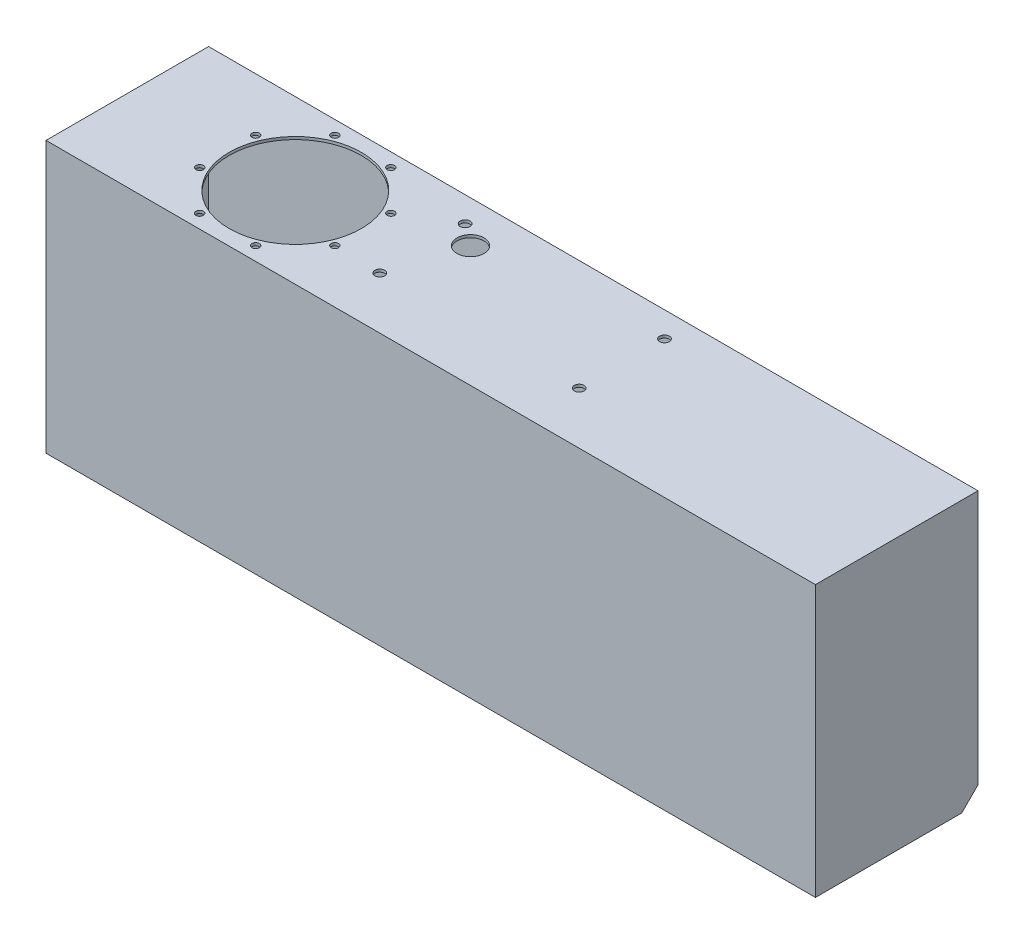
ISO-10303-21;
HEADER;
FILE_DESCRIPTION(('STEP AP214'),'2;1');
FILE_NAME('part.step','',(''),(''),'','','');
FILE_SCHEMA(('AUTOMOTIVE_DESIGN { 1 0 10303 214 1 1 1 1 }'));
ENDSEC;
DATA;
#1=APPLICATION_CONTEXT('core data for automotive mechanical design processes');
#2=APPLICATION_PROTOCOL_DEFINITION('international standard','automotive_design',2000,#1);
#3=PRODUCT_CONTEXT('',#1,'mechanical');
#4=PRODUCT('Part','Part','',(#3));
#5=PRODUCT_RELATED_PRODUCT_CATEGORY('part','',(#4));
#6=PRODUCT_DEFINITION_FORMATION('','',#4);
#7=PRODUCT_DEFINITION_CONTEXT('part definition',#1,'design');
#8=PRODUCT_DEFINITION('design','',#6,#7);
#9=PRODUCT_DEFINITION_SHAPE('','',#8);
#10=(LENGTH_UNIT() NAMED_UNIT(*) SI_UNIT(.MILLI.,.METRE.));
#11=(NAMED_UNIT(*) PLANE_ANGLE_UNIT() SI_UNIT($,.RADIAN.));
#12=(NAMED_UNIT(*) SI_UNIT($,.STERADIAN.) SOLID_ANGLE_UNIT());
#13=UNCERTAINTY_MEASURE_WITH_UNIT(LENGTH_MEASURE(1.E-05),#10,'distance_accuracy_value','');
#14=(GEOMETRIC_REPRESENTATION_CONTEXT(3) GLOBAL_UNCERTAINTY_ASSIGNED_CONTEXT((#13)) GLOBAL_UNIT_ASSIGNED_CONTEXT((#10,
#11,#12)) REPRESENTATION_CONTEXT('',''));
#15=CARTESIAN_POINT('',(0.,0.,0.));
#16=DIRECTION('',(0.,0.,1.));
#17=DIRECTION('',(1.,0.,0.));
#18=AXIS2_PLACEMENT_3D('',#15,#16,#17);
#19=CARTESIAN_POINT('',(0.,17.5000000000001,2.5));
#20=DIRECTION('',(0.,-0.707106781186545,-0.70710678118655));
#21=DIRECTION('',(0.,0.70710678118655,-0.707106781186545));
#22=AXIS2_PLACEMENT_3D('',#19,#20,#21);
#23=PLANE('',#22);
#24=CARTESIAN_POINT('',(255.,-1.90192378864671,21.9019237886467));
#25=DIRECTION('',(0.,-0.707106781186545,-0.70710678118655));
#26=DIRECTION('',(0.,-0.70710678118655,0.707106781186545));
#27=AXIS2_PLACEMENT_3D('',#24,#25,#26);
#28=ELLIPSE('',#27,12.9409522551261,12.5);
#29=CARTESIAN_POINT('',(265.95865642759,2.5,17.5));
#30=VERTEX_POINT('',#29);
#31=CARTESIAN_POINT('',(244.04134357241,2.5,17.5));
#32=VERTEX_POINT('',#31);
#33=EDGE_CURVE('E47',#30,#32,#28,.F.);
#34=ORIENTED_EDGE('',*,*,#33,.F.);
#35=DIRECTION('',(-1.,0.,0.));
#36=VECTOR('',#35,1.);
#37=CARTESIAN_POINT('',(2.5,2.5,17.5));
#38=LINE('',#37,#36);
#39=CARTESIAN_POINT('',(707.5,2.5,17.5));
#40=VERTEX_POINT('',#39);
#41=EDGE_CURVE('E144',#40,#30,#38,.T.);
#42=ORIENTED_EDGE('',*,*,#41,.F.);
#43=DIRECTION('',(0.,-0.70710678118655,0.707106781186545));
#44=VECTOR('',#43,1.);
#45=CARTESIAN_POINT('',(707.5,-62.5,82.4999999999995));
#46=LINE('',#45,#44);
#47=CARTESIAN_POINT('',(707.5,17.5000000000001,2.5));
#48=VERTEX_POINT('',#47);
#49=EDGE_CURVE('E235',#48,#40,#46,.T.);
#50=ORIENTED_EDGE('',*,*,#49,.F.);
#51=DIRECTION('',(1.,0.,0.));
#52=VECTOR('',#51,1.);
#53=CARTESIAN_POINT('',(0.,17.5000000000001,2.5));
#54=LINE('',#53,#52);
#55=CARTESIAN_POINT('',(2.5,17.5000000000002,2.49999999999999));
#56=VERTEX_POINT('',#55);
#57=EDGE_CURVE('E232',#56,#48,#54,.T.);
#58=ORIENTED_EDGE('',*,*,#57,.F.);
#59=DIRECTION('',(0.,0.70710678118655,-0.707106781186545));
#60=VECTOR('',#59,1.);
#61=CARTESIAN_POINT('',(2.5,60.0000000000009,-40.0000000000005));
#62=LINE('',#61,#60);
#63=CARTESIAN_POINT('',(2.5,2.49999999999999,17.5000000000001));
#64=VERTEX_POINT('',#63);
#65=EDGE_CURVE('E142',#64,#56,#62,.T.);
#66=ORIENTED_EDGE('',*,*,#65,.F.);
#67=CARTESIAN_POINT('',(66.5358983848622,2.5,17.5));
#68=VERTEX_POINT('',#67);
#69=EDGE_CURVE('E164',#68,#64,#38,.T.);
#70=ORIENTED_EDGE('',*,*,#69,.F.);
#71=CARTESIAN_POINT('',(70.,-3.00000000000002,23.));
#72=DIRECTION('',(0.,-0.707106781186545,-0.70710678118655));
#73=DIRECTION('',(0.,-0.70710678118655,0.707106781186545));
#74=AXIS2_PLACEMENT_3D('',#71,#72,#73);
#75=ELLIPSE('',#74,9.19238815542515,6.5);
#76=CARTESIAN_POINT('',(73.4641016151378,2.5,17.5));
#77=VERTEX_POINT('',#76);
#78=EDGE_CURVE('E157',#68,#77,#75,.T.);
#79=ORIENTED_EDGE('',*,*,#78,.T.);
#80=EDGE_CURVE('E162',#32,#77,#38,.T.);
#81=ORIENTED_EDGE('',*,*,#80,.F.);
#82=EDGE_LOOP('',(#34,#42,#50,#58,#66,#70,#79,#81));
#83=FACE_BOUND('',#82,.T.);
#84=ADVANCED_FACE('F33',(#83),#23,.F.);
#85=CARTESIAN_POINT('',(2.5,2.5,147.5));
#86=DIRECTION('',(0.,1.,0.));
#87=DIRECTION('',(0.,0.,1.));
#88=AXIS2_PLACEMENT_3D('',#85,#86,#87);
#89=PLANE('',#88);
#90=ORIENTED_EDGE('',*,*,#41,.T.);
#91=CARTESIAN_POINT('',(255.,2.5,24.443375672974));
#92=DIRECTION('',(0.,1.,0.));
#93=DIRECTION('',(0.,0.,-1.));
#94=AXIS2_PLACEMENT_3D('',#91,#92,#93);
#95=ELLIPSE('',#94,14.4337567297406,12.5);
#96=EDGE_CURVE('E135',#30,#32,#95,.F.);
#97=ORIENTED_EDGE('',*,*,#96,.T.);
#98=ORIENTED_EDGE('',*,*,#80,.T.);
#99=CARTESIAN_POINT('',(70.,2.5,23.));
#100=DIRECTION('',(0.,1.,0.));
#101=DIRECTION('',(0.,0.,1.));
#102=AXIS2_PLACEMENT_3D('',#99,#100,#101);
#103=CIRCLE('',#102,6.5);
#104=EDGE_CURVE('E41',#68,#77,#103,.T.);
#105=ORIENTED_EDGE('',*,*,#104,.F.);
#106=ORIENTED_EDGE('',*,*,#69,.T.);
#107=DIRECTION('',(0.,0.,-1.));
#108=VECTOR('',#107,1.);
#109=CARTESIAN_POINT('',(2.5,2.5,147.5));
#110=LINE('',#109,#108);
#111=CARTESIAN_POINT('',(2.5,2.5,147.5));
#112=VERTEX_POINT('',#111);
#113=EDGE_CURVE('E212',#112,#64,#110,.T.);
#114=ORIENTED_EDGE('',*,*,#113,.F.);
#115=DIRECTION('',(1.,0.,0.));
#116=VECTOR('',#115,1.);
#117=CARTESIAN_POINT('',(2.5,2.5,147.5));
#118=LINE('',#117,#116);
#119=CARTESIAN_POINT('',(707.5,2.5,147.5));
#120=VERTEX_POINT('',#119);
#121=EDGE_CURVE('E195',#112,#120,#118,.T.);
#122=ORIENTED_EDGE('',*,*,#121,.T.);
#123=DIRECTION('',(0.,0.,-1.));
#124=VECTOR('',#123,1.);
#125=CARTESIAN_POINT('',(707.5,2.5,147.5));
#126=LINE('',#125,#124);
#127=EDGE_CURVE('E209',#120,#40,#126,.T.);
#128=ORIENTED_EDGE('',*,*,#127,.T.);
#129=EDGE_LOOP('',(#90,#97,#98,#105,#106,#114,#122,#128));
#130=FACE_BOUND('',#129,.T.);
#131=ADVANCED_FACE('F239',(#130),#89,.T.);
#132=CARTESIAN_POINT('',(0.,0.,2.5));
#133=DIRECTION('',(0.,1.,0.));
#134=DIRECTION('',(0.,0.,1.));
#135=AXIS2_PLACEMENT_3D('',#132,#133,#134);
#136=PLANE('',#135);
#137=CARTESIAN_POINT('',(70.,0.,23.));
#138=DIRECTION('',(0.,-1.,0.));
#139=DIRECTION('',(0.,0.,-1.));
#140=AXIS2_PLACEMENT_3D('',#137,#138,#139);
#141=CIRCLE('',#140,6.5);
#142=CARTESIAN_POINT('',(70.,0.,16.5));
#143=VERTEX_POINT('',#142);
#144=EDGE_CURVE('E166',#143,#143,#141,.T.);
#145=ORIENTED_EDGE('',*,*,#144,.F.);
#146=EDGE_LOOP('',(#145));
#147=FACE_BOUND('',#146,.T.);
#148=CARTESIAN_POINT('',(255.,0.,23.));
#149=DIRECTION('',(0.,1.,0.));
#150=DIRECTION('',(0.,0.,-1.));
#151=AXIS2_PLACEMENT_3D('',#148,#149,#150);
#152=ELLIPSE('',#151,14.4337567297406,12.5);
#153=CARTESIAN_POINT('',(265.404326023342,0.,14.9999999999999));
#154=VERTEX_POINT('',#153);
#155=CARTESIAN_POINT('',(244.595673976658,0.,14.9999999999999));
#156=VERTEX_POINT('',#155);
#157=EDGE_CURVE('E54',#154,#156,#152,.F.);
#158=ORIENTED_EDGE('',*,*,#157,.F.);
#159=DIRECTION('',(1.,0.,0.));
#160=VECTOR('',#159,1.);
#161=CARTESIAN_POINT('',(710.,0.,14.9999999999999));
#162=LINE('',#161,#160);
#163=CARTESIAN_POINT('',(710.,0.,14.9999999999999));
#164=VERTEX_POINT('',#163);
#165=EDGE_CURVE('E131',#154,#164,#162,.T.);
#166=ORIENTED_EDGE('',*,*,#165,.T.);
#167=DIRECTION('',(0.,0.,-1.));
#168=VECTOR('',#167,1.);
#169=CARTESIAN_POINT('',(710.,0.,2.5));
#170=LINE('',#169,#168);
#171=CARTESIAN_POINT('',(710.,0.,150.));
#172=VERTEX_POINT('',#171);
#173=EDGE_CURVE('E228',#172,#164,#170,.T.);
#174=ORIENTED_EDGE('',*,*,#173,.F.);
#175=DIRECTION('',(1.,0.,0.));
#176=VECTOR('',#175,1.);
#177=CARTESIAN_POINT('',(0.,0.,150.));
#178=LINE('',#177,#176);
#179=CARTESIAN_POINT('',(0.,0.,150.));
#180=VERTEX_POINT('',#179);
#181=EDGE_CURVE('E169',#180,#172,#178,.T.);
#182=ORIENTED_EDGE('',*,*,#181,.F.);
#183=DIRECTION('',(0.,0.,-1.));
#184=VECTOR('',#183,1.);
#185=CARTESIAN_POINT('',(0.,0.,2.5));
#186=LINE('',#185,#184);
#187=CARTESIAN_POINT('',(0.,0.,14.9999999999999));
#188=VERTEX_POINT('',#187);
#189=EDGE_CURVE('E230',#180,#188,#186,.T.);
#190=ORIENTED_EDGE('',*,*,#189,.T.);
#191=EDGE_CURVE('E134',#188,#156,#162,.T.);
#192=ORIENTED_EDGE('',*,*,#191,.T.);
#193=EDGE_LOOP('',(#158,#166,#174,#182,#190,#192));
#194=FACE_BOUND('',#193,.T.);
#195=ADVANCED_FACE('F130',(#147,#194),#136,.F.);
#196=CARTESIAN_POINT('',(0.,0.,14.9999999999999));
#197=DIRECTION('',(0.,-0.707106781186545,-0.70710678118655));
#198=DIRECTION('',(0.,0.70710678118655,-0.707106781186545));
#199=AXIS2_PLACEMENT_3D('',#196,#197,#198);
#200=PLANE('',#199);
#201=ORIENTED_EDGE('',*,*,#165,.F.);
#202=CARTESIAN_POINT('',(255.,-5.0717967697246,20.0717967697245));
#203=DIRECTION('',(0.,-0.707106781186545,-0.70710678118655));
#204=DIRECTION('',(0.,-0.70710678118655,0.707106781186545));
#205=AXIS2_PLACEMENT_3D('',#202,#203,#204);
#206=ELLIPSE('',#205,12.9409522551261,12.5);
#207=EDGE_CURVE('E11',#154,#156,#206,.F.);
#208=ORIENTED_EDGE('',*,*,#207,.T.);
#209=ORIENTED_EDGE('',*,*,#191,.F.);
#210=DIRECTION('',(0.,-0.70710678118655,0.707106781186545));
#211=VECTOR('',#210,1.);
#212=CARTESIAN_POINT('',(0.,0.,14.9999999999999));
#213=LINE('',#212,#211);
#214=CARTESIAN_POINT('',(0.,15.,0.));
#215=VERTEX_POINT('',#214);
#216=EDGE_CURVE('E151',#215,#188,#213,.T.);
#217=ORIENTED_EDGE('',*,*,#216,.F.);
#218=DIRECTION('',(-1.,0.,0.));
#219=VECTOR('',#218,1.);
#220=CARTESIAN_POINT('',(0.,15.,0.));
#221=LINE('',#220,#219);
#222=CARTESIAN_POINT('',(710.,15.,0.));
#223=VERTEX_POINT('',#222);
#224=EDGE_CURVE('E149',#223,#215,#221,.T.);
#225=ORIENTED_EDGE('',*,*,#224,.F.);
#226=DIRECTION('',(0.,0.70710678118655,-0.707106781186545));
#227=VECTOR('',#226,1.);
#228=CARTESIAN_POINT('',(710.,0.,14.9999999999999));
#229=LINE('',#228,#227);
#230=EDGE_CURVE('E140',#164,#223,#229,.T.);
#231=ORIENTED_EDGE('',*,*,#230,.F.);
#232=EDGE_LOOP('',(#201,#208,#209,#217,#225,#231));
#233=FACE_BOUND('',#232,.T.);
#234=ADVANCED_FACE('F138',(#233),#200,.T.);
#235=CARTESIAN_POINT('',(0.,250.,2.5));
#236=DIRECTION('',(0.,0.,-1.));
#237=DIRECTION('',(-1.,0.,0.));
#238=AXIS2_PLACEMENT_3D('',#235,#236,#237);
#239=PLANE('',#238);
#240=DIRECTION('',(0.,-1.,0.));
#241=VECTOR('',#240,1.);
#242=CARTESIAN_POINT('',(2.5,247.5,2.5));
#243=LINE('',#242,#241);
#244=CARTESIAN_POINT('',(2.5,247.5,2.5));
#245=VERTEX_POINT('',#244);
#246=EDGE_CURVE('E184',#245,#56,#243,.T.);
#247=ORIENTED_EDGE('',*,*,#246,.T.);
#248=ORIENTED_EDGE('',*,*,#57,.T.);
#249=DIRECTION('',(0.,1.,0.));
#250=VECTOR('',#249,1.);
#251=CARTESIAN_POINT('',(707.5,2.5,2.5));
#252=LINE('',#251,#250);
#253=CARTESIAN_POINT('',(707.5,247.5,2.5));
#254=VERTEX_POINT('',#253);
#255=EDGE_CURVE('E187',#48,#254,#252,.T.);
#256=ORIENTED_EDGE('',*,*,#255,.T.);
#257=DIRECTION('',(-1.,0.,0.));
#258=VECTOR('',#257,1.);
#259=CARTESIAN_POINT('',(707.5,247.5,2.5));
#260=LINE('',#259,#258);
#261=EDGE_CURVE('E189',#254,#245,#260,.T.);
#262=ORIENTED_EDGE('',*,*,#261,.T.);
#263=EDGE_LOOP('',(#247,#248,#256,#262));
#264=FACE_BOUND('',#263,.T.);
#265=ADVANCED_FACE('F247',(#264),#239,.F.);
#266=CARTESIAN_POINT('',(707.5,247.5,147.5));
#267=DIRECTION('',(0.,-1.,0.));
#268=DIRECTION('',(0.,0.,-1.));
#269=AXIS2_PLACEMENT_3D('',#266,#267,#268);
#270=PLANE('',#269);
#271=CARTESIAN_POINT('',(217.361868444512,247.5,49.1688683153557));
#272=DIRECTION('',(0.,-1.,0.));
#273=DIRECTION('',(0.,0.,-1.));
#274=AXIS2_PLACEMENT_3D('',#271,#272,#273);
#275=CIRCLE('',#274,3.39999999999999);
#276=CARTESIAN_POINT('',(217.361868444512,247.5,45.7688683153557));
#277=VERTEX_POINT('',#276);
#278=EDGE_CURVE('E395',#277,#277,#275,.T.);
#279=ORIENTED_EDGE('',*,*,#278,.F.);
#280=EDGE_LOOP('',(#279));
#281=FACE_BOUND('',#280,.T.);
#282=CARTESIAN_POINT('',(217.361868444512,247.5,100.831131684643));
#283=DIRECTION('',(0.,-1.,0.));
#284=DIRECTION('',(0.,0.,-1.));
#285=AXIS2_PLACEMENT_3D('',#282,#283,#284);
#286=CIRCLE('',#285,3.39999999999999);
#287=CARTESIAN_POINT('',(217.361868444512,247.5,97.4311316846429));
#288=VERTEX_POINT('',#287);
#289=EDGE_CURVE('E406',#288,#288,#286,.T.);
#290=ORIENTED_EDGE('',*,*,#289,.F.);
#291=EDGE_LOOP('',(#290));
#292=FACE_BOUND('',#291,.T.);
#293=CARTESIAN_POINT('',(180.831131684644,247.5,137.361868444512));
#294=DIRECTION('',(0.,-1.,0.));
#295=DIRECTION('',(0.,0.,-1.));
#296=AXIS2_PLACEMENT_3D('',#293,#294,#295);
#297=CIRCLE('',#296,3.39999999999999);
#298=CARTESIAN_POINT('',(180.831131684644,247.5,133.961868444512));
#299=VERTEX_POINT('',#298);
#300=EDGE_CURVE('E412',#299,#299,#297,.T.);
#301=ORIENTED_EDGE('',*,*,#300,.F.);
#302=EDGE_LOOP('',(#301));
#303=FACE_BOUND('',#302,.T.);
#304=CARTESIAN_POINT('',(129.168868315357,247.5,137.361868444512));
#305=DIRECTION('',(0.,-1.,0.));
#306=DIRECTION('',(0.,0.,-1.));
#307=AXIS2_PLACEMENT_3D('',#304,#305,#306);
#308=CIRCLE('',#307,3.39999999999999);
#309=CARTESIAN_POINT('',(129.168868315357,247.5,133.961868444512));
#310=VERTEX_POINT('',#309);
#311=EDGE_CURVE('E418',#310,#310,#308,.T.);
#312=ORIENTED_EDGE('',*,*,#311,.F.);
#313=EDGE_LOOP('',(#312));
#314=FACE_BOUND('',#313,.T.);
#315=CARTESIAN_POINT('',(92.6381315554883,247.5,100.831131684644));
#316=DIRECTION('',(0.,-1.,0.));
#317=DIRECTION('',(0.,0.,-1.));
#318=AXIS2_PLACEMENT_3D('',#315,#316,#317);
#319=CIRCLE('',#318,3.4);
#320=CARTESIAN_POINT('',(92.6381315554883,247.5,97.4311316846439));
#321=VERTEX_POINT('',#320);
#322=EDGE_CURVE('E424',#321,#321,#319,.T.);
#323=ORIENTED_EDGE('',*,*,#322,.F.);
#324=EDGE_LOOP('',(#323));
#325=FACE_BOUND('',#324,.T.);
#326=CARTESIAN_POINT('',(92.6381315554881,247.5,49.1688683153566));
#327=DIRECTION('',(0.,-1.,0.));
#328=DIRECTION('',(0.,0.,-1.));
#329=AXIS2_PLACEMENT_3D('',#326,#327,#328);
#330=CIRCLE('',#329,3.4);
#331=CARTESIAN_POINT('',(92.6381315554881,247.5,45.7688683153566));
#332=VERTEX_POINT('',#331);
#333=EDGE_CURVE('E430',#332,#332,#330,.T.);
#334=ORIENTED_EDGE('',*,*,#333,.F.);
#335=EDGE_LOOP('',(#334));
#336=FACE_BOUND('',#335,.T.);
#337=CARTESIAN_POINT('',(129.168868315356,247.5,12.6381315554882));
#338=DIRECTION('',(0.,-1.,0.));
#339=DIRECTION('',(0.,0.,-1.));
#340=AXIS2_PLACEMENT_3D('',#337,#338,#339);
#341=CIRCLE('',#340,3.39999999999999);
#342=CARTESIAN_POINT('',(129.168868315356,247.5,9.23813155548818));
#343=VERTEX_POINT('',#342);
#344=EDGE_CURVE('E436',#343,#343,#341,.T.);
#345=ORIENTED_EDGE('',*,*,#344,.F.);
#346=EDGE_LOOP('',(#345));
#347=FACE_BOUND('',#346,.T.);
#348=CARTESIAN_POINT('',(180.831131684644,247.5,12.6381315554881));
#349=DIRECTION('',(0.,-1.,0.));
#350=DIRECTION('',(0.,0.,-1.));
#351=AXIS2_PLACEMENT_3D('',#348,#349,#350);
#352=CIRCLE('',#351,3.39999999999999);
#353=CARTESIAN_POINT('',(180.831131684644,247.5,9.23813155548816));
#354=VERTEX_POINT('',#353);
#355=EDGE_CURVE('E442',#354,#354,#352,.T.);
#356=ORIENTED_EDGE('',*,*,#355,.F.);
#357=EDGE_LOOP('',(#356));
#358=FACE_BOUND('',#357,.T.);
#359=CARTESIAN_POINT('',(443.999999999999,247.5,23.273279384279));
#360=DIRECTION('',(0.,-1.,0.));
#361=DIRECTION('',(0.,0.,-1.));
#362=AXIS2_PLACEMENT_3D('',#359,#360,#361);
#363=CIRCLE('',#362,4.50000000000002);
#364=CARTESIAN_POINT('',(443.999999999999,247.5,18.773279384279));
#365=VERTEX_POINT('',#364);
#366=EDGE_CURVE('E260',#365,#365,#363,.T.);
#367=ORIENTED_EDGE('',*,*,#366,.F.);
#368=EDGE_LOOP('',(#367));
#369=FACE_BOUND('',#368,.T.);
#370=CARTESIAN_POINT('',(259.999999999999,247.5,23.2732793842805));
#371=DIRECTION('',(0.,-1.,0.));
#372=DIRECTION('',(0.,0.,-1.));
#373=AXIS2_PLACEMENT_3D('',#370,#371,#372);
#374=CIRCLE('',#373,4.50000000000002);
#375=CARTESIAN_POINT('',(259.999999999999,247.5,18.7732793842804));
#376=VERTEX_POINT('',#375);
#377=EDGE_CURVE('E269',#376,#376,#374,.T.);
#378=ORIENTED_EDGE('',*,*,#377,.F.);
#379=EDGE_LOOP('',(#378));
#380=FACE_BOUND('',#379,.T.);
#381=CARTESIAN_POINT('',(444.,247.5,101.999999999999));
#382=DIRECTION('',(0.,-1.,0.));
#383=DIRECTION('',(0.,0.,-1.));
#384=AXIS2_PLACEMENT_3D('',#381,#382,#383);
#385=CIRCLE('',#384,4.50000000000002);
#386=CARTESIAN_POINT('',(444.,247.5,97.4999999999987));
#387=VERTEX_POINT('',#386);
#388=EDGE_CURVE('E275',#387,#387,#385,.T.);
#389=ORIENTED_EDGE('',*,*,#388,.F.);
#390=EDGE_LOOP('',(#389));
#391=FACE_BOUND('',#390,.T.);
#392=CARTESIAN_POINT('',(279.999999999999,247.5,38.2732793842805));
#393=DIRECTION('',(0.,-1.,0.));
#394=DIRECTION('',(0.,0.,-1.));
#395=AXIS2_PLACEMENT_3D('',#392,#393,#394);
#396=CIRCLE('',#395,12.4999999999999);
#397=CARTESIAN_POINT('',(279.999999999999,247.5,25.7732793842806));
#398=VERTEX_POINT('',#397);
#399=EDGE_CURVE('E281',#398,#398,#396,.T.);
#400=ORIENTED_EDGE('',*,*,#399,.F.);
#401=EDGE_LOOP('',(#400));
#402=FACE_BOUND('',#401,.T.);
#403=CARTESIAN_POINT('',(260.,247.5,102.));
#404=DIRECTION('',(0.,-1.,0.));
#405=DIRECTION('',(0.,0.,-1.));
#406=AXIS2_PLACEMENT_3D('',#403,#404,#405);
#407=CIRCLE('',#406,4.50000000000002);
#408=CARTESIAN_POINT('',(260.,247.5,97.5));
#409=VERTEX_POINT('',#408);
#410=EDGE_CURVE('E287',#409,#409,#407,.T.);
#411=ORIENTED_EDGE('',*,*,#410,.F.);
#412=EDGE_LOOP('',(#411));
#413=FACE_BOUND('',#412,.T.);
#414=CARTESIAN_POINT('',(155.,247.5,75.));
#415=DIRECTION('',(0.,-1.,0.));
#416=DIRECTION('',(0.,0.,-1.));
#417=AXIS2_PLACEMENT_3D('',#414,#415,#416);
#418=CIRCLE('',#417,61.);
#419=CARTESIAN_POINT('',(155.,247.5,14.));
#420=VERTEX_POINT('',#419);
#421=EDGE_CURVE('E172',#420,#420,#418,.T.);
#422=ORIENTED_EDGE('',*,*,#421,.F.);
#423=EDGE_LOOP('',(#422));
#424=FACE_BOUND('',#423,.T.);
#425=ORIENTED_EDGE('',*,*,#261,.F.);
#426=DIRECTION('',(0.,0.,-1.));
#427=VECTOR('',#426,1.);
#428=CARTESIAN_POINT('',(707.5,247.5,147.5));
#429=LINE('',#428,#427);
#430=CARTESIAN_POINT('',(707.5,247.5,147.5));
#431=VERTEX_POINT('',#430);
#432=EDGE_CURVE('E206',#431,#254,#429,.T.);
#433=ORIENTED_EDGE('',*,*,#432,.F.);
#434=DIRECTION('',(-1.,0.,0.));
#435=VECTOR('',#434,1.);
#436=CARTESIAN_POINT('',(707.5,247.5,147.5));
#437=LINE('',#436,#435);
#438=CARTESIAN_POINT('',(2.5,247.5,147.5));
#439=VERTEX_POINT('',#438);
#440=EDGE_CURVE('E201',#431,#439,#437,.T.);
#441=ORIENTED_EDGE('',*,*,#440,.T.);
#442=DIRECTION('',(0.,0.,-1.));
#443=VECTOR('',#442,1.);
#444=CARTESIAN_POINT('',(2.5,247.5,147.5));
#445=LINE('',#444,#443);
#446=EDGE_CURVE('E204',#439,#245,#445,.T.);
#447=ORIENTED_EDGE('',*,*,#446,.T.);
#448=EDGE_LOOP('',(#425,#433,#441,#447));
#449=FACE_BOUND('',#448,.T.);
#450=ADVANCED_FACE('F254',(#281,#292,#303,#314,#325,#336,#347,#358,#369,#380,#391,#402,#413,
#424,#449),#270,.T.);
#451=CARTESIAN_POINT('',(707.5,2.5,147.5));
#452=DIRECTION('',(-1.,0.,0.));
#453=DIRECTION('',(0.,0.,1.));
#454=AXIS2_PLACEMENT_3D('',#451,#452,#453);
#455=PLANE('',#454);
#456=ORIENTED_EDGE('',*,*,#255,.F.);
#457=ORIENTED_EDGE('',*,*,#49,.T.);
#458=ORIENTED_EDGE('',*,*,#127,.F.);
#459=DIRECTION('',(0.,1.,0.));
#460=VECTOR('',#459,1.);
#461=CARTESIAN_POINT('',(707.5,2.5,147.5));
#462=LINE('',#461,#460);
#463=EDGE_CURVE('E198',#120,#431,#462,.T.);
#464=ORIENTED_EDGE('',*,*,#463,.T.);
#465=ORIENTED_EDGE('',*,*,#432,.T.);
#466=EDGE_LOOP('',(#456,#457,#458,#464,#465));
#467=FACE_BOUND('',#466,.T.);
#468=ADVANCED_FACE('F249',(#467),#455,.T.);
#469=CARTESIAN_POINT('',(2.5,247.5,147.5));
#470=DIRECTION('',(1.,0.,0.));
#471=DIRECTION('',(0.,0.,-1.));
#472=AXIS2_PLACEMENT_3D('',#469,#470,#471);
#473=PLANE('',#472);
#474=CARTESIAN_POINT('',(2.5,220.,120.));
#475=DIRECTION('',(1.,0.,0.));
#476=DIRECTION('',(0.,0.,-1.));
#477=AXIS2_PLACEMENT_3D('',#474,#475,#476);
#478=CIRCLE('',#477,4.25);
#479=CARTESIAN_POINT('',(2.5,220.,115.75));
#480=VERTEX_POINT('',#479);
#481=EDGE_CURVE('E448',#480,#480,#478,.T.);
#482=ORIENTED_EDGE('',*,*,#481,.F.);
#483=EDGE_LOOP('',(#482));
#484=FACE_BOUND('',#483,.T.);
#485=CARTESIAN_POINT('',(2.5,144.,120.));
#486=DIRECTION('',(1.,0.,0.));
#487=DIRECTION('',(0.,0.,-1.));
#488=AXIS2_PLACEMENT_3D('',#485,#486,#487);
#489=CIRCLE('',#488,4.25);
#490=CARTESIAN_POINT('',(2.5,144.,115.75));
#491=VERTEX_POINT('',#490);
#492=EDGE_CURVE('E136',#491,#491,#489,.T.);
#493=ORIENTED_EDGE('',*,*,#492,.F.);
#494=EDGE_LOOP('',(#493));
#495=FACE_BOUND('',#494,.T.);
#496=ORIENTED_EDGE('',*,*,#113,.T.);
#497=ORIENTED_EDGE('',*,*,#65,.T.);
#498=ORIENTED_EDGE('',*,*,#246,.F.);
#499=ORIENTED_EDGE('',*,*,#446,.F.);
#500=DIRECTION('',(0.,-1.,0.));
#501=VECTOR('',#500,1.);
#502=CARTESIAN_POINT('',(2.5,247.5,147.5));
#503=LINE('',#502,#501);
#504=EDGE_CURVE('E192',#439,#112,#503,.T.);
#505=ORIENTED_EDGE('',*,*,#504,.T.);
#506=EDGE_LOOP('',(#496,#497,#498,#499,#505));
#507=FACE_BOUND('',#506,.T.);
#508=ADVANCED_FACE('F241',(#484,#495,#507),#473,.T.);
#509=CARTESIAN_POINT('',(0.,0.,147.5));
#510=DIRECTION('',(0.,0.,1.));
#511=DIRECTION('',(1.,0.,0.));
#512=AXIS2_PLACEMENT_3D('',#509,#510,#511);
#513=PLANE('',#512);
#514=ORIENTED_EDGE('',*,*,#504,.F.);
#515=ORIENTED_EDGE('',*,*,#440,.F.);
#516=ORIENTED_EDGE('',*,*,#463,.F.);
#517=ORIENTED_EDGE('',*,*,#121,.F.);
#518=EDGE_LOOP('',(#514,#515,#516,#517));
#519=FACE_BOUND('',#518,.T.);
#520=ADVANCED_FACE('F256',(#519),#513,.F.);
#521=CARTESIAN_POINT('',(70.,25.,23.));
#522=DIRECTION('',(0.,-1.,0.));
#523=DIRECTION('',(0.,0.,-1.));
#524=AXIS2_PLACEMENT_3D('',#521,#522,#523);
#525=CYLINDRICAL_SURFACE('',#524,6.5);
#526=ORIENTED_EDGE('',*,*,#144,.T.);
#527=EDGE_LOOP('',(#526));
#528=FACE_BOUND('',#527,.T.);
#529=ORIENTED_EDGE('',*,*,#104,.T.);
#530=ORIENTED_EDGE('',*,*,#78,.F.);
#531=EDGE_LOOP('',(#529,#530));
#532=FACE_BOUND('',#531,.T.);
#533=ADVANCED_FACE('F156',(#528,#532),#525,.F.);
#534=CARTESIAN_POINT('',(0.,0.,2.5));
#535=DIRECTION('',(1.,0.,0.));
#536=DIRECTION('',(0.,0.,-1.));
#537=AXIS2_PLACEMENT_3D('',#534,#535,#536);
#538=PLANE('',#537);
#539=CARTESIAN_POINT('',(0.,220.,120.));
#540=DIRECTION('',(-1.,0.,0.));
#541=DIRECTION('',(0.,0.,1.));
#542=AXIS2_PLACEMENT_3D('',#539,#540,#541);
#543=CIRCLE('',#542,4.25);
#544=CARTESIAN_POINT('',(0.,220.,124.25));
#545=VERTEX_POINT('',#544);
#546=EDGE_CURVE('E445',#545,#545,#543,.T.);
#547=ORIENTED_EDGE('',*,*,#546,.F.);
#548=EDGE_LOOP('',(#547));
#549=FACE_BOUND('',#548,.T.);
#550=CARTESIAN_POINT('',(0.,144.,120.));
#551=DIRECTION('',(-1.,0.,0.));
#552=DIRECTION('',(0.,0.,1.));
#553=AXIS2_PLACEMENT_3D('',#550,#551,#552);
#554=CIRCLE('',#553,4.25);
#555=CARTESIAN_POINT('',(0.,144.,124.25));
#556=VERTEX_POINT('',#555);
#557=EDGE_CURVE('E451',#556,#556,#554,.T.);
#558=ORIENTED_EDGE('',*,*,#557,.F.);
#559=EDGE_LOOP('',(#558));
#560=FACE_BOUND('',#559,.T.);
#561=DIRECTION('',(0.,-1.,0.));
#562=VECTOR('',#561,1.);
#563=CARTESIAN_POINT('',(0.,0.,0.));
#564=LINE('',#563,#562);
#565=CARTESIAN_POINT('',(0.,250.,0.));
#566=VERTEX_POINT('',#565);
#567=EDGE_CURVE('E215',#566,#215,#564,.T.);
#568=ORIENTED_EDGE('',*,*,#567,.T.);
#569=ORIENTED_EDGE('',*,*,#216,.T.);
#570=ORIENTED_EDGE('',*,*,#189,.F.);
#571=DIRECTION('',(0.,-1.,0.));
#572=VECTOR('',#571,1.);
#573=CARTESIAN_POINT('',(0.,250.,150.));
#574=LINE('',#573,#572);
#575=CARTESIAN_POINT('',(0.,250.,150.));
#576=VERTEX_POINT('',#575);
#577=EDGE_CURVE('E165',#576,#180,#574,.T.);
#578=ORIENTED_EDGE('',*,*,#577,.F.);
#579=DIRECTION('',(0.,0.,-1.));
#580=VECTOR('',#579,1.);
#581=CARTESIAN_POINT('',(0.,250.,2.5));
#582=LINE('',#581,#580);
#583=EDGE_CURVE('E222',#576,#566,#582,.T.);
#584=ORIENTED_EDGE('',*,*,#583,.T.);
#585=EDGE_LOOP('',(#568,#569,#570,#578,#584));
#586=FACE_BOUND('',#585,.T.);
#587=ADVANCED_FACE('F35',(#549,#560,#586),#538,.F.);
#588=CARTESIAN_POINT('',(710.,0.,2.5));
#589=DIRECTION('',(-1.,0.,0.));
#590=DIRECTION('',(0.,0.,1.));
#591=AXIS2_PLACEMENT_3D('',#588,#589,#590);
#592=PLANE('',#591);
#593=ORIENTED_EDGE('',*,*,#173,.T.);
#594=ORIENTED_EDGE('',*,*,#230,.T.);
#595=DIRECTION('',(0.,1.,0.));
#596=VECTOR('',#595,1.);
#597=CARTESIAN_POINT('',(710.,0.,0.));
#598=LINE('',#597,#596);
#599=CARTESIAN_POINT('',(710.,250.,0.));
#600=VERTEX_POINT('',#599);
#601=EDGE_CURVE('E218',#223,#600,#598,.T.);
#602=ORIENTED_EDGE('',*,*,#601,.T.);
#603=DIRECTION('',(0.,0.,-1.));
#604=VECTOR('',#603,1.);
#605=CARTESIAN_POINT('',(710.,250.,2.5));
#606=LINE('',#605,#604);
#607=CARTESIAN_POINT('',(710.,250.,150.));
#608=VERTEX_POINT('',#607);
#609=EDGE_CURVE('E225',#608,#600,#606,.T.);
#610=ORIENTED_EDGE('',*,*,#609,.F.);
#611=DIRECTION('',(0.,1.,0.));
#612=VECTOR('',#611,1.);
#613=CARTESIAN_POINT('',(710.,0.,150.));
#614=LINE('',#613,#612);
#615=EDGE_CURVE('E178',#172,#608,#614,.T.);
#616=ORIENTED_EDGE('',*,*,#615,.F.);
#617=EDGE_LOOP('',(#593,#594,#602,#610,#616));
#618=FACE_BOUND('',#617,.T.);
#619=ADVANCED_FACE('F471',(#618),#592,.F.);
#620=CARTESIAN_POINT('',(0.,250.,2.5));
#621=DIRECTION('',(0.,-1.,0.));
#622=DIRECTION('',(0.,0.,-1.));
#623=AXIS2_PLACEMENT_3D('',#620,#621,#622);
#624=PLANE('',#623);
#625=CARTESIAN_POINT('',(217.361868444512,250.,49.1688683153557));
#626=DIRECTION('',(0.,1.,0.));
#627=DIRECTION('',(0.,0.,1.));
#628=AXIS2_PLACEMENT_3D('',#625,#626,#627);
#629=CIRCLE('',#628,3.39999999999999);
#630=CARTESIAN_POINT('',(217.361868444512,250.,52.5688683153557));
#631=VERTEX_POINT('',#630);
#632=EDGE_CURVE('E398',#631,#631,#629,.T.);
#633=ORIENTED_EDGE('',*,*,#632,.F.);
#634=EDGE_LOOP('',(#633));
#635=FACE_BOUND('',#634,.T.);
#636=CARTESIAN_POINT('',(217.361868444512,250.,100.831131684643));
#637=DIRECTION('',(0.,1.,0.));
#638=DIRECTION('',(0.,0.,1.));
#639=AXIS2_PLACEMENT_3D('',#636,#637,#638);
#640=CIRCLE('',#639,3.39999999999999);
#641=CARTESIAN_POINT('',(217.361868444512,250.,104.231131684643));
#642=VERTEX_POINT('',#641);
#643=EDGE_CURVE('E401',#642,#642,#640,.T.);
#644=ORIENTED_EDGE('',*,*,#643,.F.);
#645=EDGE_LOOP('',(#644));
#646=FACE_BOUND('',#645,.T.);
#647=CARTESIAN_POINT('',(180.831131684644,250.,137.361868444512));
#648=DIRECTION('',(0.,1.,0.));
#649=DIRECTION('',(0.,0.,1.));
#650=AXIS2_PLACEMENT_3D('',#647,#648,#649);
#651=CIRCLE('',#650,3.39999999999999);
#652=CARTESIAN_POINT('',(180.831131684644,250.,140.761868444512));
#653=VERTEX_POINT('',#652);
#654=EDGE_CURVE('E409',#653,#653,#651,.T.);
#655=ORIENTED_EDGE('',*,*,#654,.F.);
#656=EDGE_LOOP('',(#655));
#657=FACE_BOUND('',#656,.T.);
#658=CARTESIAN_POINT('',(129.168868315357,250.,137.361868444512));
#659=DIRECTION('',(0.,1.,0.));
#660=DIRECTION('',(0.,0.,1.));
#661=AXIS2_PLACEMENT_3D('',#658,#659,#660);
#662=CIRCLE('',#661,3.39999999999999);
#663=CARTESIAN_POINT('',(129.168868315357,250.,140.761868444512));
#664=VERTEX_POINT('',#663);
#665=EDGE_CURVE('E415',#664,#664,#662,.T.);
#666=ORIENTED_EDGE('',*,*,#665,.F.);
#667=EDGE_LOOP('',(#666));
#668=FACE_BOUND('',#667,.T.);
#669=CARTESIAN_POINT('',(92.6381315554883,250.,100.831131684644));
#670=DIRECTION('',(0.,1.,0.));
#671=DIRECTION('',(0.,0.,1.));
#672=AXIS2_PLACEMENT_3D('',#669,#670,#671);
#673=CIRCLE('',#672,3.4);
#674=CARTESIAN_POINT('',(92.6381315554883,250.,104.231131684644));
#675=VERTEX_POINT('',#674);
#676=EDGE_CURVE('E421',#675,#675,#673,.T.);
#677=ORIENTED_EDGE('',*,*,#676,.F.);
#678=EDGE_LOOP('',(#677));
#679=FACE_BOUND('',#678,.T.);
#680=CARTESIAN_POINT('',(92.6381315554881,250.,49.1688683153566));
#681=DIRECTION('',(0.,1.,0.));
#682=DIRECTION('',(0.,0.,1.));
#683=AXIS2_PLACEMENT_3D('',#680,#681,#682);
#684=CIRCLE('',#683,3.4);
#685=CARTESIAN_POINT('',(92.6381315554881,250.,52.5688683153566));
#686=VERTEX_POINT('',#685);
#687=EDGE_CURVE('E427',#686,#686,#684,.T.);
#688=ORIENTED_EDGE('',*,*,#687,.F.);
#689=EDGE_LOOP('',(#688));
#690=FACE_BOUND('',#689,.T.);
#691=CARTESIAN_POINT('',(129.168868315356,250.,12.6381315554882));
#692=DIRECTION('',(0.,1.,0.));
#693=DIRECTION('',(0.,0.,1.));
#694=AXIS2_PLACEMENT_3D('',#691,#692,#693);
#695=CIRCLE('',#694,3.39999999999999);
#696=CARTESIAN_POINT('',(129.168868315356,250.,16.0381315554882));
#697=VERTEX_POINT('',#696);
#698=EDGE_CURVE('E433',#697,#697,#695,.T.);
#699=ORIENTED_EDGE('',*,*,#698,.F.);
#700=EDGE_LOOP('',(#699));
#701=FACE_BOUND('',#700,.T.);
#702=CARTESIAN_POINT('',(180.831131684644,250.,12.6381315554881));
#703=DIRECTION('',(0.,1.,0.));
#704=DIRECTION('',(0.,0.,1.));
#705=AXIS2_PLACEMENT_3D('',#702,#703,#704);
#706=CIRCLE('',#705,3.39999999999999);
#707=CARTESIAN_POINT('',(180.831131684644,250.,16.0381315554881));
#708=VERTEX_POINT('',#707);
#709=EDGE_CURVE('E439',#708,#708,#706,.T.);
#710=ORIENTED_EDGE('',*,*,#709,.F.);
#711=EDGE_LOOP('',(#710));
#712=FACE_BOUND('',#711,.T.);
#713=CARTESIAN_POINT('',(443.999999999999,250.,23.273279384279));
#714=DIRECTION('',(0.,1.,0.));
#715=DIRECTION('',(0.,0.,1.));
#716=AXIS2_PLACEMENT_3D('',#713,#714,#715);
#717=CIRCLE('',#716,4.50000000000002);
#718=CARTESIAN_POINT('',(443.999999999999,250.,27.773279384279));
#719=VERTEX_POINT('',#718);
#720=EDGE_CURVE('E257',#719,#719,#717,.T.);
#721=ORIENTED_EDGE('',*,*,#720,.F.);
#722=EDGE_LOOP('',(#721));
#723=FACE_BOUND('',#722,.T.);
#724=CARTESIAN_POINT('',(259.999999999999,250.,23.2732793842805));
#725=DIRECTION('',(0.,1.,0.));
#726=DIRECTION('',(0.,0.,1.));
#727=AXIS2_PLACEMENT_3D('',#724,#725,#726);
#728=CIRCLE('',#727,4.50000000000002);
#729=CARTESIAN_POINT('',(259.999999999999,250.,27.7732793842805));
#730=VERTEX_POINT('',#729);
#731=EDGE_CURVE('E266',#730,#730,#728,.T.);
#732=ORIENTED_EDGE('',*,*,#731,.F.);
#733=EDGE_LOOP('',(#732));
#734=FACE_BOUND('',#733,.T.);
#735=CARTESIAN_POINT('',(444.,250.,101.999999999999));
#736=DIRECTION('',(0.,1.,0.));
#737=DIRECTION('',(0.,0.,1.));
#738=AXIS2_PLACEMENT_3D('',#735,#736,#737);
#739=CIRCLE('',#738,4.50000000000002);
#740=CARTESIAN_POINT('',(444.,250.,106.499999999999));
#741=VERTEX_POINT('',#740);
#742=EDGE_CURVE('E272',#741,#741,#739,.T.);
#743=ORIENTED_EDGE('',*,*,#742,.F.);
#744=EDGE_LOOP('',(#743));
#745=FACE_BOUND('',#744,.T.);
#746=CARTESIAN_POINT('',(279.999999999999,250.,38.2732793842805));
#747=DIRECTION('',(0.,1.,0.));
#748=DIRECTION('',(0.,0.,1.));
#749=AXIS2_PLACEMENT_3D('',#746,#747,#748);
#750=CIRCLE('',#749,12.4999999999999);
#751=CARTESIAN_POINT('',(279.999999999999,250.,50.7732793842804));
#752=VERTEX_POINT('',#751);
#753=EDGE_CURVE('E278',#752,#752,#750,.T.);
#754=ORIENTED_EDGE('',*,*,#753,.F.);
#755=EDGE_LOOP('',(#754));
#756=FACE_BOUND('',#755,.T.);
#757=CARTESIAN_POINT('',(260.,250.,102.));
#758=DIRECTION('',(0.,1.,0.));
#759=DIRECTION('',(0.,0.,1.));
#760=AXIS2_PLACEMENT_3D('',#757,#758,#759);
#761=CIRCLE('',#760,4.50000000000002);
#762=CARTESIAN_POINT('',(260.,250.,106.5));
#763=VERTEX_POINT('',#762);
#764=EDGE_CURVE('E284',#763,#763,#761,.T.);
#765=ORIENTED_EDGE('',*,*,#764,.F.);
#766=EDGE_LOOP('',(#765));
#767=FACE_BOUND('',#766,.T.);
#768=CARTESIAN_POINT('',(155.,250.,75.));
#769=DIRECTION('',(0.,1.,0.));
#770=DIRECTION('',(0.,0.,1.));
#771=AXIS2_PLACEMENT_3D('',#768,#769,#770);
#772=CIRCLE('',#771,61.);
#773=CARTESIAN_POINT('',(155.,250.,136.));
#774=VERTEX_POINT('',#773);
#775=EDGE_CURVE('E290',#774,#774,#772,.T.);
#776=ORIENTED_EDGE('',*,*,#775,.F.);
#777=EDGE_LOOP('',(#776));
#778=FACE_BOUND('',#777,.T.);
#779=DIRECTION('',(-1.,0.,0.));
#780=VECTOR('',#779,1.);
#781=CARTESIAN_POINT('',(0.,250.,0.));
#782=LINE('',#781,#780);
#783=EDGE_CURVE('E220',#600,#566,#782,.T.);
#784=ORIENTED_EDGE('',*,*,#783,.T.);
#785=ORIENTED_EDGE('',*,*,#583,.F.);
#786=DIRECTION('',(-1.,0.,0.));
#787=VECTOR('',#786,1.);
#788=CARTESIAN_POINT('',(710.,250.,150.));
#789=LINE('',#788,#787);
#790=EDGE_CURVE('E181',#608,#576,#789,.T.);
#791=ORIENTED_EDGE('',*,*,#790,.F.);
#792=ORIENTED_EDGE('',*,*,#609,.T.);
#793=EDGE_LOOP('',(#784,#785,#791,#792));
#794=FACE_BOUND('',#793,.T.);
#795=ADVANCED_FACE('F466',(#635,#646,#657,#668,#679,#690,#701,#712,#723,#734,#745,#756,#767,
#778,#794),#624,.F.);
#796=CARTESIAN_POINT('',(0.,250.,0.));
#797=DIRECTION('',(0.,0.,-1.));
#798=DIRECTION('',(-1.,0.,0.));
#799=AXIS2_PLACEMENT_3D('',#796,#797,#798);
#800=PLANE('',#799);
#801=ORIENTED_EDGE('',*,*,#601,.F.);
#802=ORIENTED_EDGE('',*,*,#224,.T.);
#803=ORIENTED_EDGE('',*,*,#567,.F.);
#804=ORIENTED_EDGE('',*,*,#783,.F.);
#805=EDGE_LOOP('',(#801,#802,#803,#804));
#806=FACE_BOUND('',#805,.T.);
#807=ADVANCED_FACE('F321',(#806),#800,.T.);
#808=CARTESIAN_POINT('',(0.,0.,150.));
#809=DIRECTION('',(0.,0.,1.));
#810=DIRECTION('',(1.,0.,0.));
#811=AXIS2_PLACEMENT_3D('',#808,#809,#810);
#812=PLANE('',#811);
#813=ORIENTED_EDGE('',*,*,#577,.T.);
#814=ORIENTED_EDGE('',*,*,#181,.T.);
#815=ORIENTED_EDGE('',*,*,#615,.T.);
#816=ORIENTED_EDGE('',*,*,#790,.T.);
#817=EDGE_LOOP('',(#813,#814,#815,#816));
#818=FACE_BOUND('',#817,.T.);
#819=ADVANCED_FACE('F318',(#818),#812,.T.);
#820=CARTESIAN_POINT('',(155.,225.,75.));
#821=DIRECTION('',(0.,1.,0.));
#822=DIRECTION('',(0.,0.,1.));
#823=AXIS2_PLACEMENT_3D('',#820,#821,#822);
#824=CYLINDRICAL_SURFACE('',#823,61.);
#825=ORIENTED_EDGE('',*,*,#421,.T.);
#826=EDGE_LOOP('',(#825));
#827=FACE_BOUND('',#826,.T.);
#828=ORIENTED_EDGE('',*,*,#775,.T.);
#829=EDGE_LOOP('',(#828));
#830=FACE_BOUND('',#829,.T.);
#831=ADVANCED_FACE('F295',(#827,#830),#824,.F.);
#832=CARTESIAN_POINT('',(260.,225.,102.));
#833=DIRECTION('',(0.,1.,0.));
#834=DIRECTION('',(0.,0.,1.));
#835=AXIS2_PLACEMENT_3D('',#832,#833,#834);
#836=CYLINDRICAL_SURFACE('',#835,4.50000000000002);
#837=ORIENTED_EDGE('',*,*,#410,.T.);
#838=EDGE_LOOP('',(#837));
#839=FACE_BOUND('',#838,.T.);
#840=ORIENTED_EDGE('',*,*,#764,.T.);
#841=EDGE_LOOP('',(#840));
#842=FACE_BOUND('',#841,.T.);
#843=ADVANCED_FACE('F330',(#839,#842),#836,.F.);
#844=CARTESIAN_POINT('',(279.999999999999,225.,38.2732793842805));
#845=DIRECTION('',(0.,1.,0.));
#846=DIRECTION('',(0.,0.,1.));
#847=AXIS2_PLACEMENT_3D('',#844,#845,#846);
#848=CYLINDRICAL_SURFACE('',#847,12.4999999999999);
#849=ORIENTED_EDGE('',*,*,#399,.T.);
#850=EDGE_LOOP('',(#849));
#851=FACE_BOUND('',#850,.T.);
#852=ORIENTED_EDGE('',*,*,#753,.T.);
#853=EDGE_LOOP('',(#852));
#854=FACE_BOUND('',#853,.T.);
#855=ADVANCED_FACE('F333',(#851,#854),#848,.F.);
#856=CARTESIAN_POINT('',(444.,225.,101.999999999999));
#857=DIRECTION('',(0.,1.,0.));
#858=DIRECTION('',(0.,0.,1.));
#859=AXIS2_PLACEMENT_3D('',#856,#857,#858);
#860=CYLINDRICAL_SURFACE('',#859,4.50000000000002);
#861=ORIENTED_EDGE('',*,*,#388,.T.);
#862=EDGE_LOOP('',(#861));
#863=FACE_BOUND('',#862,.T.);
#864=ORIENTED_EDGE('',*,*,#742,.T.);
#865=EDGE_LOOP('',(#864));
#866=FACE_BOUND('',#865,.T.);
#867=ADVANCED_FACE('F337',(#863,#866),#860,.F.);
#868=CARTESIAN_POINT('',(259.999999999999,225.,23.2732793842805));
#869=DIRECTION('',(0.,1.,0.));
#870=DIRECTION('',(0.,0.,1.));
#871=AXIS2_PLACEMENT_3D('',#868,#869,#870);
#872=CYLINDRICAL_SURFACE('',#871,4.50000000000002);
#873=ORIENTED_EDGE('',*,*,#377,.T.);
#874=EDGE_LOOP('',(#873));
#875=FACE_BOUND('',#874,.T.);
#876=ORIENTED_EDGE('',*,*,#731,.T.);
#877=EDGE_LOOP('',(#876));
#878=FACE_BOUND('',#877,.T.);
#879=ADVANCED_FACE('F341',(#875,#878),#872,.F.);
#880=CARTESIAN_POINT('',(443.999999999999,225.,23.273279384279));
#881=DIRECTION('',(0.,1.,0.));
#882=DIRECTION('',(0.,0.,1.));
#883=AXIS2_PLACEMENT_3D('',#880,#881,#882);
#884=CYLINDRICAL_SURFACE('',#883,4.50000000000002);
#885=ORIENTED_EDGE('',*,*,#366,.T.);
#886=EDGE_LOOP('',(#885));
#887=FACE_BOUND('',#886,.T.);
#888=ORIENTED_EDGE('',*,*,#720,.T.);
#889=EDGE_LOOP('',(#888));
#890=FACE_BOUND('',#889,.T.);
#891=ADVANCED_FACE('F345',(#887,#890),#884,.F.);
#892=CARTESIAN_POINT('',(255.,0.,23.));
#893=DIRECTION('',(0.,-0.866025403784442,-0.499999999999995));
#894=DIRECTION('',(0.,0.499999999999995,-0.866025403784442));
#895=AXIS2_PLACEMENT_3D('',#892,#893,#894);
#896=CYLINDRICAL_SURFACE('',#895,12.5);
#897=ORIENTED_EDGE('',*,*,#157,.T.);
#898=ORIENTED_EDGE('',*,*,#207,.F.);
#899=EDGE_LOOP('',(#897,#898));
#900=FACE_BOUND('',#899,.T.);
#901=ORIENTED_EDGE('',*,*,#33,.T.);
#902=ORIENTED_EDGE('',*,*,#96,.F.);
#903=EDGE_LOOP('',(#901,#902));
#904=FACE_BOUND('',#903,.T.);
#905=ADVANCED_FACE('F124',(#900,#904),#896,.F.);
#906=CARTESIAN_POINT('',(0.,144.,120.));
#907=DIRECTION('',(-1.,0.,0.));
#908=DIRECTION('',(0.,0.,1.));
#909=AXIS2_PLACEMENT_3D('',#906,#907,#908);
#910=CYLINDRICAL_SURFACE('',#909,4.25);
#911=ORIENTED_EDGE('',*,*,#492,.T.);
#912=EDGE_LOOP('',(#911));
#913=FACE_BOUND('',#912,.T.);
#914=ORIENTED_EDGE('',*,*,#557,.T.);
#915=EDGE_LOOP('',(#914));
#916=FACE_BOUND('',#915,.T.);
#917=ADVANCED_FACE('F352',(#913,#916),#910,.F.);
#918=CARTESIAN_POINT('',(0.,220.,120.));
#919=DIRECTION('',(-1.,0.,0.));
#920=DIRECTION('',(0.,0.,1.));
#921=AXIS2_PLACEMENT_3D('',#918,#919,#920);
#922=CYLINDRICAL_SURFACE('',#921,4.25);
#923=ORIENTED_EDGE('',*,*,#481,.T.);
#924=EDGE_LOOP('',(#923));
#925=FACE_BOUND('',#924,.T.);
#926=ORIENTED_EDGE('',*,*,#546,.T.);
#927=EDGE_LOOP('',(#926));
#928=FACE_BOUND('',#927,.T.);
#929=ADVANCED_FACE('F355',(#925,#928),#922,.F.);
#930=CARTESIAN_POINT('',(180.831131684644,250.,12.6381315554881));
#931=DIRECTION('',(0.,1.,0.));
#932=DIRECTION('',(0.,0.,1.));
#933=AXIS2_PLACEMENT_3D('',#930,#931,#932);
#934=CYLINDRICAL_SURFACE('',#933,3.39999999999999);
#935=ORIENTED_EDGE('',*,*,#355,.T.);
#936=EDGE_LOOP('',(#935));
#937=FACE_BOUND('',#936,.T.);
#938=ORIENTED_EDGE('',*,*,#709,.T.);
#939=EDGE_LOOP('',(#938));
#940=FACE_BOUND('',#939,.T.);
#941=ADVANCED_FACE('F359',(#937,#940),#934,.F.);
#942=CARTESIAN_POINT('',(129.168868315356,250.,12.6381315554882));
#943=DIRECTION('',(0.,1.,0.));
#944=DIRECTION('',(0.,0.,1.));
#945=AXIS2_PLACEMENT_3D('',#942,#943,#944);
#946=CYLINDRICAL_SURFACE('',#945,3.39999999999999);
#947=ORIENTED_EDGE('',*,*,#344,.T.);
#948=EDGE_LOOP('',(#947));
#949=FACE_BOUND('',#948,.T.);
#950=ORIENTED_EDGE('',*,*,#698,.T.);
#951=EDGE_LOOP('',(#950));
#952=FACE_BOUND('',#951,.T.);
#953=ADVANCED_FACE('F363',(#949,#952),#946,.F.);
#954=CARTESIAN_POINT('',(92.6381315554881,250.,49.1688683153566));
#955=DIRECTION('',(0.,1.,0.));
#956=DIRECTION('',(0.,0.,1.));
#957=AXIS2_PLACEMENT_3D('',#954,#955,#956);
#958=CYLINDRICAL_SURFACE('',#957,3.4);
#959=ORIENTED_EDGE('',*,*,#333,.T.);
#960=EDGE_LOOP('',(#959));
#961=FACE_BOUND('',#960,.T.);
#962=ORIENTED_EDGE('',*,*,#687,.T.);
#963=EDGE_LOOP('',(#962));
#964=FACE_BOUND('',#963,.T.);
#965=ADVANCED_FACE('F367',(#961,#964),#958,.F.);
#966=CARTESIAN_POINT('',(92.6381315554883,250.,100.831131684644));
#967=DIRECTION('',(0.,1.,0.));
#968=DIRECTION('',(0.,0.,1.));
#969=AXIS2_PLACEMENT_3D('',#966,#967,#968);
#970=CYLINDRICAL_SURFACE('',#969,3.4);
#971=ORIENTED_EDGE('',*,*,#322,.T.);
#972=EDGE_LOOP('',(#971));
#973=FACE_BOUND('',#972,.T.);
#974=ORIENTED_EDGE('',*,*,#676,.T.);
#975=EDGE_LOOP('',(#974));
#976=FACE_BOUND('',#975,.T.);
#977=ADVANCED_FACE('F371',(#973,#976),#970,.F.);
#978=CARTESIAN_POINT('',(129.168868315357,250.,137.361868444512));
#979=DIRECTION('',(0.,1.,0.));
#980=DIRECTION('',(0.,0.,1.));
#981=AXIS2_PLACEMENT_3D('',#978,#979,#980);
#982=CYLINDRICAL_SURFACE('',#981,3.39999999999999);
#983=ORIENTED_EDGE('',*,*,#311,.T.);
#984=EDGE_LOOP('',(#983));
#985=FACE_BOUND('',#984,.T.);
#986=ORIENTED_EDGE('',*,*,#665,.T.);
#987=EDGE_LOOP('',(#986));
#988=FACE_BOUND('',#987,.T.);
#989=ADVANCED_FACE('F375',(#985,#988),#982,.F.);
#990=CARTESIAN_POINT('',(180.831131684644,250.,137.361868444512));
#991=DIRECTION('',(0.,1.,0.));
#992=DIRECTION('',(0.,0.,1.));
#993=AXIS2_PLACEMENT_3D('',#990,#991,#992);
#994=CYLINDRICAL_SURFACE('',#993,3.39999999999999);
#995=ORIENTED_EDGE('',*,*,#300,.T.);
#996=EDGE_LOOP('',(#995));
#997=FACE_BOUND('',#996,.T.);
#998=ORIENTED_EDGE('',*,*,#654,.T.);
#999=EDGE_LOOP('',(#998));
#1000=FACE_BOUND('',#999,.T.);
#1001=ADVANCED_FACE('F379',(#997,#1000),#994,.F.);
#1002=CARTESIAN_POINT('',(217.361868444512,250.,100.831131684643));
#1003=DIRECTION('',(0.,1.,0.));
#1004=DIRECTION('',(0.,0.,1.));
#1005=AXIS2_PLACEMENT_3D('',#1002,#1003,#1004);
#1006=CYLINDRICAL_SURFACE('',#1005,3.39999999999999);
#1007=ORIENTED_EDGE('',*,*,#289,.T.);
#1008=EDGE_LOOP('',(#1007));
#1009=FACE_BOUND('',#1008,.T.);
#1010=ORIENTED_EDGE('',*,*,#643,.T.);
#1011=EDGE_LOOP('',(#1010));
#1012=FACE_BOUND('',#1011,.T.);
#1013=ADVANCED_FACE('F383',(#1009,#1012),#1006,.F.);
#1014=CARTESIAN_POINT('',(217.361868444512,250.,49.1688683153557));
#1015=DIRECTION('',(0.,1.,0.));
#1016=DIRECTION('',(0.,0.,1.));
#1017=AXIS2_PLACEMENT_3D('',#1014,#1015,#1016);
#1018=CYLINDRICAL_SURFACE('',#1017,3.39999999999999);
#1019=ORIENTED_EDGE('',*,*,#278,.T.);
#1020=EDGE_LOOP('',(#1019));
#1021=FACE_BOUND('',#1020,.T.);
#1022=ORIENTED_EDGE('',*,*,#632,.T.);
#1023=EDGE_LOOP('',(#1022));
#1024=FACE_BOUND('',#1023,.T.);
#1025=ADVANCED_FACE('F387',(#1021,#1024),#1018,.F.);
#1026=CLOSED_SHELL('',(#84,#131,#195,#234,#265,#450,#468,#508,#520,#533,#587,#619,#795,#807,
#819,#831,#843,#855,#867,#879,#891,#905,#917,#929,#941,#953,#965,#977,#989,#1001,#1013,#1025));
#1027=MANIFOLD_SOLID_BREP('B2',#1026);
#1028=ADVANCED_BREP_SHAPE_REPRESENTATION('',(#18,#1027),#14);
#1029=SHAPE_DEFINITION_REPRESENTATION(#9,#1028);
ENDSEC;
END-ISO-10303-21;
